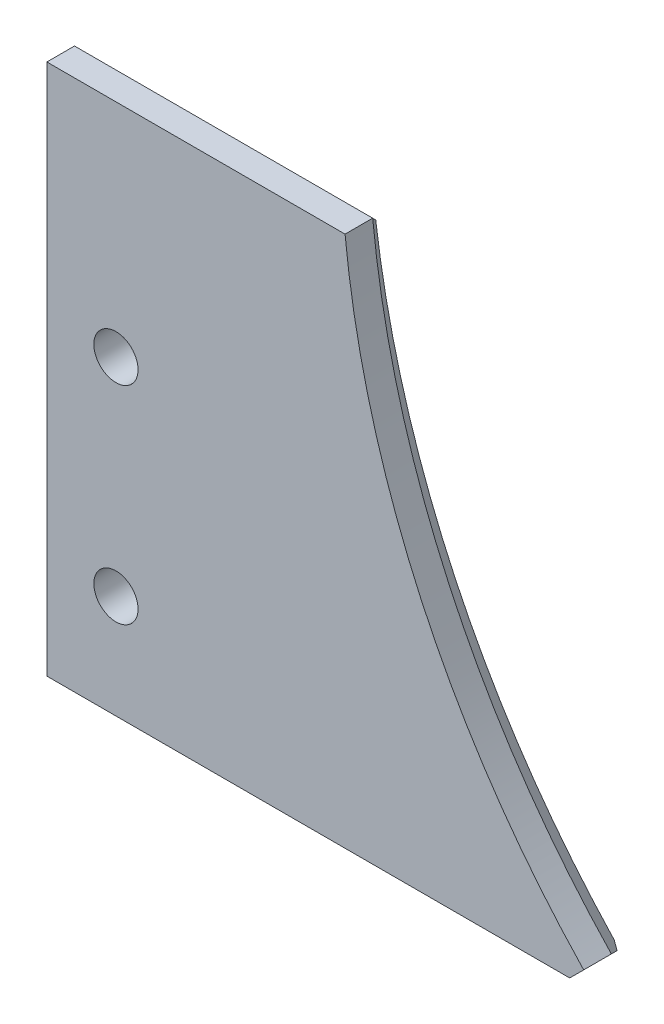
from build123d import *
from OCP.BRepFilletAPI import BRepFilletAPI_MakeChamfer

# Parameters (mm, degrees)
EXTRUDE_1_DEPTH     = 4
SKETCH_3_W          = 4
SKETCH_3_H          = 0.5
CUT_EXTRUDE_2_DEPTH = 61.237413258
SKETCH_5_R          = 1.6
CUT_EXTRUDE_4_DEPTH = 4
CHAMFER_2_SIZE      = 2
CHAMFER_2_SIZE2     = 1.414215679


with BuildPart() as part:
    # Sketch 1 → Extrude 1 (new body)
    with BuildSketch(Plane.XY):
        with BuildLine():
            Line((-63.467018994, -6), (-85, -6))
            Line((-85, -6), (-85, -45))
            Line((-85, -45), (-45.15597967, -45))
            ThreePointArc((-45.15597967, -45), (-57.706056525, -27.093791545), (-63.467018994, -6))
        make_face()
    extrude(amount=EXTRUDE_1_DEPTH)

    # Sketch 3 → Cut-Extrude 2 (cut, through all)
    with BuildSketch(Plane.ZY.offset(85)):
        with Locations((2, -6.25)):
            Rectangle(SKETCH_3_W, SKETCH_3_H)
    extrude(amount=-CUT_EXTRUDE_2_DEPTH, mode=Mode.SUBTRACT)

    # Sketch 5 → Cut-Extrude 4 (cut)
    with BuildSketch(Plane.XY.offset(4)):
        with Locations((-80, -37.5)):
            Circle(SKETCH_5_R)
        with Locations((-80, -22.5)):
            Circle(SKETCH_5_R)
    extrude(amount=-CUT_EXTRUDE_4_DEPTH, mode=Mode.SUBTRACT)

    # Chamfer 2: one chamfer whose edges measure the first distance from different faces: ONE call of the kernel's chamfer builder (chamfer() names one face for all edges)
    chamfer_2_edges_1 = [part.edges().sort_by_distance(p)[0] for p in [
        (-57.598843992, -27.320974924, 0),
        (-74.208880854, -6.5, 0),
    ]]
    chamfer_2_edges_2 = [part.edges().sort_by_distance(p)[0] for p in [
        (-45.15597967, -45, 2),
    ]]
    chamfer_2_side_2 = [part.faces().sort_by_distance(p)[0] for p in [
        (-65.077989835, -45, 2),
    ]]
    chamfer_2 = BRepFilletAPI_MakeChamfer(part.part.solid().wrapped)
    for e in chamfer_2_edges_1:
        chamfer_2.Add(CHAMFER_2_SIZE, e.wrapped)
    for e in chamfer_2_edges_2:
        chamfer_2.Add(CHAMFER_2_SIZE, CHAMFER_2_SIZE2, e.wrapped, chamfer_2_side_2[0].wrapped)  # the first distance lies on this face
    add(Compound.cast(chamfer_2.Shape()), mode=Mode.REPLACE)


solid = part.part
